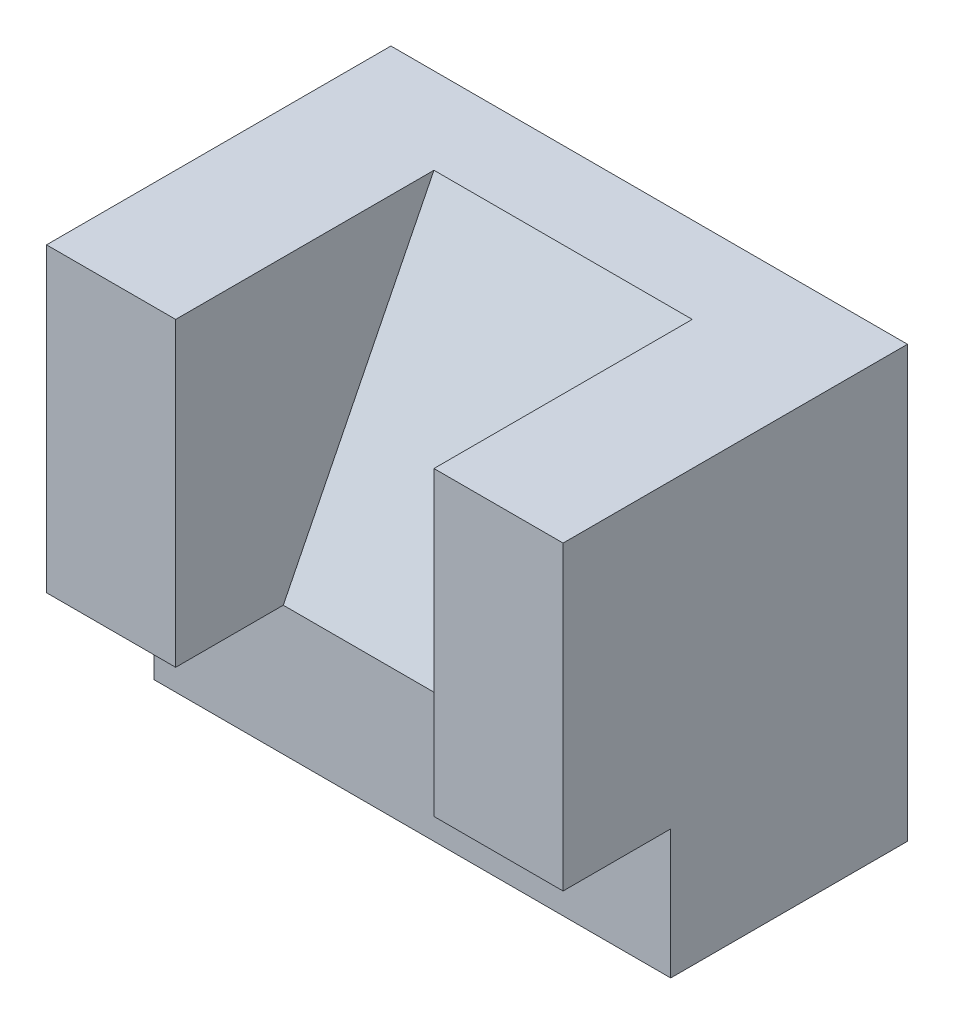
ISO-10303-21;
HEADER;
FILE_DESCRIPTION(('STEP AP214'),'2;1');
FILE_NAME('part.step','',(''),(''),'','','');
FILE_SCHEMA(('AUTOMOTIVE_DESIGN { 1 0 10303 214 1 1 1 1 }'));
ENDSEC;
DATA;
#1=APPLICATION_CONTEXT('core data for automotive mechanical design processes');
#2=APPLICATION_PROTOCOL_DEFINITION('international standard','automotive_design',2000,#1);
#3=PRODUCT_CONTEXT('',#1,'mechanical');
#4=PRODUCT('Part','Part','',(#3));
#5=PRODUCT_RELATED_PRODUCT_CATEGORY('part','',(#4));
#6=PRODUCT_DEFINITION_FORMATION('','',#4);
#7=PRODUCT_DEFINITION_CONTEXT('part definition',#1,'design');
#8=PRODUCT_DEFINITION('design','',#6,#7);
#9=PRODUCT_DEFINITION_SHAPE('','',#8);
#10=(LENGTH_UNIT() NAMED_UNIT(*) SI_UNIT(.MILLI.,.METRE.));
#11=(NAMED_UNIT(*) PLANE_ANGLE_UNIT() SI_UNIT($,.RADIAN.));
#12=(NAMED_UNIT(*) SI_UNIT($,.STERADIAN.) SOLID_ANGLE_UNIT());
#13=UNCERTAINTY_MEASURE_WITH_UNIT(LENGTH_MEASURE(1.E-05),#10,'distance_accuracy_value','');
#14=(GEOMETRIC_REPRESENTATION_CONTEXT(3) GLOBAL_UNCERTAINTY_ASSIGNED_CONTEXT((#13)) GLOBAL_UNIT_ASSIGNED_CONTEXT((#10,
#11,#12)) REPRESENTATION_CONTEXT('',''));
#15=CARTESIAN_POINT('',(0.,0.,0.));
#16=DIRECTION('',(0.,0.,1.));
#17=DIRECTION('',(1.,0.,0.));
#18=AXIS2_PLACEMENT_3D('',#15,#16,#17);
#19=CARTESIAN_POINT('',(0.,0.,-72.3198506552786));
#20=DIRECTION('',(0.,-1.,0.));
#21=DIRECTION('',(0.,0.,-1.));
#22=AXIS2_PLACEMENT_3D('',#19,#20,#21);
#23=PLANE('',#22);
#24=DIRECTION('',(-1.,0.,0.));
#25=VECTOR('',#24,1.);
#26=CARTESIAN_POINT('',(0.,0.,80.));
#27=LINE('',#26,#25);
#28=CARTESIAN_POINT('',(60.,0.,80.));
#29=VERTEX_POINT('',#28);
#30=CARTESIAN_POINT('',(30.,0.,80.));
#31=VERTEX_POINT('',#30);
#32=EDGE_CURVE('E133',#29,#31,#27,.T.);
#33=ORIENTED_EDGE('',*,*,#32,.T.);
#34=DIRECTION('',(0.,0.,-1.));
#35=VECTOR('',#34,1.);
#36=CARTESIAN_POINT('',(30.,0.,80.));
#37=LINE('',#36,#35);
#38=CARTESIAN_POINT('',(30.,0.,55.));
#39=VERTEX_POINT('',#38);
#40=EDGE_CURVE('E233',#31,#39,#37,.T.);
#41=ORIENTED_EDGE('',*,*,#40,.T.);
#42=DIRECTION('',(-1.,0.,0.));
#43=VECTOR('',#42,1.);
#44=CARTESIAN_POINT('',(0.,0.,55.));
#45=LINE('',#44,#43);
#46=CARTESIAN_POINT('',(60.,0.,55.));
#47=VERTEX_POINT('',#46);
#48=EDGE_CURVE('E79',#47,#39,#45,.T.);
#49=ORIENTED_EDGE('',*,*,#48,.F.);
#50=DIRECTION('',(0.,0.,-1.));
#51=VECTOR('',#50,1.);
#52=CARTESIAN_POINT('',(60.,0.,-72.3198506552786));
#53=LINE('',#52,#51);
#54=EDGE_CURVE('E126',#29,#47,#53,.T.);
#55=ORIENTED_EDGE('',*,*,#54,.F.);
#56=EDGE_LOOP('',(#33,#41,#49,#55));
#57=FACE_BOUND('',#56,.T.);
#58=ADVANCED_FACE('F30',(#57),#23,.T.);
#59=CARTESIAN_POINT('',(0.,70.,80.));
#60=DIRECTION('',(0.,0.,1.));
#61=DIRECTION('',(1.,0.,0.));
#62=AXIS2_PLACEMENT_3D('',#59,#60,#61);
#63=PLANE('',#62);
#64=DIRECTION('',(-1.,0.,0.));
#65=VECTOR('',#64,1.);
#66=CARTESIAN_POINT('',(0.,70.,80.));
#67=LINE('',#66,#65);
#68=CARTESIAN_POINT('',(60.,70.,80.));
#69=VERTEX_POINT('',#68);
#70=CARTESIAN_POINT('',(30.,70.,80.));
#71=VERTEX_POINT('',#70);
#72=EDGE_CURVE('E175',#69,#71,#67,.T.);
#73=ORIENTED_EDGE('',*,*,#72,.T.);
#74=DIRECTION('',(0.,-1.,0.));
#75=VECTOR('',#74,1.);
#76=CARTESIAN_POINT('',(30.,70.,80.));
#77=LINE('',#76,#75);
#78=EDGE_CURVE('E48',#71,#31,#77,.T.);
#79=ORIENTED_EDGE('',*,*,#78,.T.);
#80=ORIENTED_EDGE('',*,*,#32,.F.);
#81=DIRECTION('',(0.,-1.,0.));
#82=VECTOR('',#81,1.);
#83=CARTESIAN_POINT('',(60.,70.,80.));
#84=LINE('',#83,#82);
#85=EDGE_CURVE('E129',#69,#29,#84,.T.);
#86=ORIENTED_EDGE('',*,*,#85,.F.);
#87=EDGE_LOOP('',(#73,#79,#80,#86));
#88=FACE_BOUND('',#87,.T.);
#89=ADVANCED_FACE('F225',(#88),#63,.T.);
#90=CARTESIAN_POINT('',(0.,-30.,0.));
#91=DIRECTION('',(0.,0.,-1.));
#92=DIRECTION('',(-1.,0.,0.));
#93=AXIS2_PLACEMENT_3D('',#90,#91,#92);
#94=PLANE('',#93);
#95=DIRECTION('',(0.,1.,0.));
#96=VECTOR('',#95,1.);
#97=CARTESIAN_POINT('',(-60.,-30.,0.));
#98=LINE('',#97,#96);
#99=CARTESIAN_POINT('',(-60.,-30.,0.));
#100=VERTEX_POINT('',#99);
#101=CARTESIAN_POINT('',(-60.,70.,0.));
#102=VERTEX_POINT('',#101);
#103=EDGE_CURVE('E105',#100,#102,#98,.T.);
#104=ORIENTED_EDGE('',*,*,#103,.T.);
#105=DIRECTION('',(-1.,0.,0.));
#106=VECTOR('',#105,1.);
#107=CARTESIAN_POINT('',(0.,70.,0.));
#108=LINE('',#107,#106);
#109=CARTESIAN_POINT('',(60.,70.,0.));
#110=VERTEX_POINT('',#109);
#111=EDGE_CURVE('E146',#110,#102,#108,.T.);
#112=ORIENTED_EDGE('',*,*,#111,.F.);
#113=DIRECTION('',(0.,1.,0.));
#114=VECTOR('',#113,1.);
#115=CARTESIAN_POINT('',(60.,-30.,0.));
#116=LINE('',#115,#114);
#117=CARTESIAN_POINT('',(60.,-30.,0.));
#118=VERTEX_POINT('',#117);
#119=EDGE_CURVE('E11',#118,#110,#116,.T.);
#120=ORIENTED_EDGE('',*,*,#119,.F.);
#121=DIRECTION('',(-1.,0.,0.));
#122=VECTOR('',#121,1.);
#123=CARTESIAN_POINT('',(0.,-30.,0.));
#124=LINE('',#123,#122);
#125=EDGE_CURVE('E109',#118,#100,#124,.T.);
#126=ORIENTED_EDGE('',*,*,#125,.T.);
#127=EDGE_LOOP('',(#104,#112,#120,#126));
#128=FACE_BOUND('',#127,.T.);
#129=ADVANCED_FACE('F32',(#128),#94,.T.);
#130=CARTESIAN_POINT('',(60.,-30.,-72.3198506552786));
#131=DIRECTION('',(1.,0.,0.));
#132=DIRECTION('',(0.,0.,-1.));
#133=AXIS2_PLACEMENT_3D('',#130,#131,#132);
#134=PLANE('',#133);
#135=ORIENTED_EDGE('',*,*,#119,.T.);
#136=DIRECTION('',(0.,0.,-1.));
#137=VECTOR('',#136,1.);
#138=CARTESIAN_POINT('',(60.,70.,-72.3198506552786));
#139=LINE('',#138,#137);
#140=EDGE_CURVE('E178',#69,#110,#139,.T.);
#141=ORIENTED_EDGE('',*,*,#140,.F.);
#142=ORIENTED_EDGE('',*,*,#85,.T.);
#143=ORIENTED_EDGE('',*,*,#54,.T.);
#144=DIRECTION('',(0.,1.,0.));
#145=VECTOR('',#144,1.);
#146=CARTESIAN_POINT('',(60.,-30.,55.));
#147=LINE('',#146,#145);
#148=CARTESIAN_POINT('',(60.,-30.,55.));
#149=VERTEX_POINT('',#148);
#150=EDGE_CURVE('E40',#149,#47,#147,.T.);
#151=ORIENTED_EDGE('',*,*,#150,.F.);
#152=DIRECTION('',(0.,0.,-1.));
#153=VECTOR('',#152,1.);
#154=CARTESIAN_POINT('',(60.,-30.,-72.3198506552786));
#155=LINE('',#154,#153);
#156=EDGE_CURVE('E97',#149,#118,#155,.T.);
#157=ORIENTED_EDGE('',*,*,#156,.T.);
#158=EDGE_LOOP('',(#135,#141,#142,#143,#151,#157));
#159=FACE_BOUND('',#158,.T.);
#160=ADVANCED_FACE('F124',(#159),#134,.T.);
#161=CARTESIAN_POINT('',(0.,-30.,55.));
#162=DIRECTION('',(0.,0.,-1.));
#163=DIRECTION('',(-1.,0.,0.));
#164=AXIS2_PLACEMENT_3D('',#161,#162,#163);
#165=PLANE('',#164);
#166=ORIENTED_EDGE('',*,*,#48,.T.);
#167=DIRECTION('',(1.,0.,0.));
#168=VECTOR('',#167,1.);
#169=CARTESIAN_POINT('',(-30.,0.,55.));
#170=LINE('',#169,#168);
#171=CARTESIAN_POINT('',(-30.,0.,55.));
#172=VERTEX_POINT('',#171);
#173=EDGE_CURVE('E163',#172,#39,#170,.T.);
#174=ORIENTED_EDGE('',*,*,#173,.F.);
#175=CARTESIAN_POINT('',(-60.,0.,55.));
#176=VERTEX_POINT('',#175);
#177=EDGE_CURVE('E34',#172,#176,#45,.T.);
#178=ORIENTED_EDGE('',*,*,#177,.T.);
#179=DIRECTION('',(0.,1.,0.));
#180=VECTOR('',#179,1.);
#181=CARTESIAN_POINT('',(-60.,-30.,55.));
#182=LINE('',#181,#180);
#183=CARTESIAN_POINT('',(-60.,-30.,55.));
#184=VERTEX_POINT('',#183);
#185=EDGE_CURVE('E101',#184,#176,#182,.T.);
#186=ORIENTED_EDGE('',*,*,#185,.F.);
#187=DIRECTION('',(-1.,0.,0.));
#188=VECTOR('',#187,1.);
#189=CARTESIAN_POINT('',(0.,-30.,55.));
#190=LINE('',#189,#188);
#191=EDGE_CURVE('E91',#149,#184,#190,.T.);
#192=ORIENTED_EDGE('',*,*,#191,.F.);
#193=ORIENTED_EDGE('',*,*,#150,.T.);
#194=EDGE_LOOP('',(#166,#174,#178,#186,#192,#193));
#195=FACE_BOUND('',#194,.T.);
#196=ADVANCED_FACE('F102',(#195),#165,.F.);
#197=CARTESIAN_POINT('',(-60.,-30.,-72.3198506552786));
#198=DIRECTION('',(1.,0.,0.));
#199=DIRECTION('',(0.,0.,-1.));
#200=AXIS2_PLACEMENT_3D('',#197,#198,#199);
#201=PLANE('',#200);
#202=ORIENTED_EDGE('',*,*,#185,.T.);
#203=DIRECTION('',(0.,0.,-1.));
#204=VECTOR('',#203,1.);
#205=CARTESIAN_POINT('',(-60.,0.,-72.3198506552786));
#206=LINE('',#205,#204);
#207=CARTESIAN_POINT('',(-60.,0.,80.));
#208=VERTEX_POINT('',#207);
#209=EDGE_CURVE('E140',#208,#176,#206,.T.);
#210=ORIENTED_EDGE('',*,*,#209,.F.);
#211=DIRECTION('',(0.,-1.,0.));
#212=VECTOR('',#211,1.);
#213=CARTESIAN_POINT('',(-60.,70.,80.));
#214=LINE('',#213,#212);
#215=CARTESIAN_POINT('',(-60.,70.,80.));
#216=VERTEX_POINT('',#215);
#217=EDGE_CURVE('E145',#216,#208,#214,.T.);
#218=ORIENTED_EDGE('',*,*,#217,.F.);
#219=DIRECTION('',(0.,0.,-1.));
#220=VECTOR('',#219,1.);
#221=CARTESIAN_POINT('',(-60.,70.,-72.3198506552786));
#222=LINE('',#221,#220);
#223=EDGE_CURVE('E132',#216,#102,#222,.T.);
#224=ORIENTED_EDGE('',*,*,#223,.T.);
#225=ORIENTED_EDGE('',*,*,#103,.F.);
#226=DIRECTION('',(0.,0.,-1.));
#227=VECTOR('',#226,1.);
#228=CARTESIAN_POINT('',(-60.,-30.,-72.3198506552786));
#229=LINE('',#228,#227);
#230=EDGE_CURVE('E94',#184,#100,#229,.T.);
#231=ORIENTED_EDGE('',*,*,#230,.F.);
#232=EDGE_LOOP('',(#202,#210,#218,#224,#225,#231));
#233=FACE_BOUND('',#232,.T.);
#234=ADVANCED_FACE('F107',(#233),#201,.F.);
#235=CARTESIAN_POINT('',(0.,-30.,-72.3198506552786));
#236=DIRECTION('',(0.,-1.,0.));
#237=DIRECTION('',(0.,0.,-1.));
#238=AXIS2_PLACEMENT_3D('',#235,#236,#237);
#239=PLANE('',#238);
#240=ORIENTED_EDGE('',*,*,#125,.F.);
#241=ORIENTED_EDGE('',*,*,#156,.F.);
#242=ORIENTED_EDGE('',*,*,#191,.T.);
#243=ORIENTED_EDGE('',*,*,#230,.T.);
#244=EDGE_LOOP('',(#240,#241,#242,#243));
#245=FACE_BOUND('',#244,.T.);
#246=ADVANCED_FACE('F92',(#245),#239,.T.);
#247=DIRECTION('',(0.,0.,-1.));
#248=VECTOR('',#247,1.);
#249=CARTESIAN_POINT('',(-30.,0.,80.));
#250=LINE('',#249,#248);
#251=CARTESIAN_POINT('',(-30.,0.,80.));
#252=VERTEX_POINT('',#251);
#253=EDGE_CURVE('E212',#252,#172,#250,.T.);
#254=ORIENTED_EDGE('',*,*,#253,.F.);
#255=EDGE_CURVE('E136',#252,#208,#27,.T.);
#256=ORIENTED_EDGE('',*,*,#255,.T.);
#257=ORIENTED_EDGE('',*,*,#209,.T.);
#258=ORIENTED_EDGE('',*,*,#177,.F.);
#259=EDGE_LOOP('',(#254,#256,#257,#258));
#260=FACE_BOUND('',#259,.T.);
#261=ADVANCED_FACE('F217',(#260),#23,.T.);
#262=DIRECTION('',(0.,-1.,0.));
#263=VECTOR('',#262,1.);
#264=CARTESIAN_POINT('',(-30.,70.,80.));
#265=LINE('',#264,#263);
#266=CARTESIAN_POINT('',(-30.,70.,80.));
#267=VERTEX_POINT('',#266);
#268=EDGE_CURVE('E170',#267,#252,#265,.T.);
#269=ORIENTED_EDGE('',*,*,#268,.F.);
#270=EDGE_CURVE('E134',#267,#216,#67,.T.);
#271=ORIENTED_EDGE('',*,*,#270,.T.);
#272=ORIENTED_EDGE('',*,*,#217,.T.);
#273=ORIENTED_EDGE('',*,*,#255,.F.);
#274=EDGE_LOOP('',(#269,#271,#272,#273));
#275=FACE_BOUND('',#274,.T.);
#276=ADVANCED_FACE('F154',(#275),#63,.T.);
#277=CARTESIAN_POINT('',(0.,70.,-72.3198506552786));
#278=DIRECTION('',(0.,-1.,0.));
#279=DIRECTION('',(0.,0.,-1.));
#280=AXIS2_PLACEMENT_3D('',#277,#278,#279);
#281=PLANE('',#280);
#282=ORIENTED_EDGE('',*,*,#270,.F.);
#283=DIRECTION('',(0.,0.,1.));
#284=VECTOR('',#283,1.);
#285=CARTESIAN_POINT('',(-30.,70.,20.));
#286=LINE('',#285,#284);
#287=CARTESIAN_POINT('',(-30.,70.,20.));
#288=VERTEX_POINT('',#287);
#289=EDGE_CURVE('E211',#288,#267,#286,.T.);
#290=ORIENTED_EDGE('',*,*,#289,.F.);
#291=DIRECTION('',(1.,0.,0.));
#292=VECTOR('',#291,1.);
#293=CARTESIAN_POINT('',(-30.,70.,20.));
#294=LINE('',#293,#292);
#295=CARTESIAN_POINT('',(30.,70.,20.));
#296=VERTEX_POINT('',#295);
#297=EDGE_CURVE('E161',#288,#296,#294,.T.);
#298=ORIENTED_EDGE('',*,*,#297,.T.);
#299=DIRECTION('',(0.,0.,1.));
#300=VECTOR('',#299,1.);
#301=CARTESIAN_POINT('',(30.,70.,20.));
#302=LINE('',#301,#300);
#303=EDGE_CURVE('E234',#296,#71,#302,.T.);
#304=ORIENTED_EDGE('',*,*,#303,.T.);
#305=ORIENTED_EDGE('',*,*,#72,.F.);
#306=ORIENTED_EDGE('',*,*,#140,.T.);
#307=ORIENTED_EDGE('',*,*,#111,.T.);
#308=ORIENTED_EDGE('',*,*,#223,.F.);
#309=EDGE_LOOP('',(#282,#290,#298,#304,#305,#306,#307,#308));
#310=FACE_BOUND('',#309,.T.);
#311=ADVANCED_FACE('F183',(#310),#281,.F.);
#312=CARTESIAN_POINT('',(-30.,0.,55.));
#313=DIRECTION('',(0.,-0.447213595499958,-0.894427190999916));
#314=DIRECTION('',(0.,0.894427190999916,-0.447213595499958));
#315=AXIS2_PLACEMENT_3D('',#312,#313,#314);
#316=PLANE('',#315);
#317=DIRECTION('',(0.,0.894427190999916,-0.447213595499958));
#318=VECTOR('',#317,1.);
#319=CARTESIAN_POINT('',(30.,0.,55.));
#320=LINE('',#319,#318);
#321=EDGE_CURVE('E235',#39,#296,#320,.T.);
#322=ORIENTED_EDGE('',*,*,#321,.T.);
#323=ORIENTED_EDGE('',*,*,#297,.F.);
#324=DIRECTION('',(0.,0.894427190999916,-0.447213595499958));
#325=VECTOR('',#324,1.);
#326=CARTESIAN_POINT('',(-30.,0.,55.));
#327=LINE('',#326,#325);
#328=EDGE_CURVE('E205',#172,#288,#327,.T.);
#329=ORIENTED_EDGE('',*,*,#328,.F.);
#330=ORIENTED_EDGE('',*,*,#173,.T.);
#331=EDGE_LOOP('',(#322,#323,#329,#330));
#332=FACE_BOUND('',#331,.T.);
#333=ADVANCED_FACE('F208',(#332),#316,.F.);
#334=CARTESIAN_POINT('',(-30.,0.,80.));
#335=DIRECTION('',(-1.,0.,0.));
#336=DIRECTION('',(0.,0.,1.));
#337=AXIS2_PLACEMENT_3D('',#334,#335,#336);
#338=PLANE('',#337);
#339=ORIENTED_EDGE('',*,*,#253,.T.);
#340=ORIENTED_EDGE('',*,*,#328,.T.);
#341=ORIENTED_EDGE('',*,*,#289,.T.);
#342=ORIENTED_EDGE('',*,*,#268,.T.);
#343=EDGE_LOOP('',(#339,#340,#341,#342));
#344=FACE_BOUND('',#343,.T.);
#345=ADVANCED_FACE('F215',(#344),#338,.F.);
#346=CARTESIAN_POINT('',(30.,0.,80.));
#347=DIRECTION('',(-1.,0.,0.));
#348=DIRECTION('',(0.,0.,1.));
#349=AXIS2_PLACEMENT_3D('',#346,#347,#348);
#350=PLANE('',#349);
#351=ORIENTED_EDGE('',*,*,#40,.F.);
#352=ORIENTED_EDGE('',*,*,#78,.F.);
#353=ORIENTED_EDGE('',*,*,#303,.F.);
#354=ORIENTED_EDGE('',*,*,#321,.F.);
#355=EDGE_LOOP('',(#351,#352,#353,#354));
#356=FACE_BOUND('',#355,.T.);
#357=ADVANCED_FACE('F240',(#356),#350,.T.);
#358=CLOSED_SHELL('',(#58,#89,#129,#160,#196,#234,#246,#261,#276,#311,#333,#345,#357));
#359=MANIFOLD_SOLID_BREP('B2',#358);
#360=ADVANCED_BREP_SHAPE_REPRESENTATION('',(#18,#359),#14);
#361=SHAPE_DEFINITION_REPRESENTATION(#9,#360);
ENDSEC;
END-ISO-10303-21;
